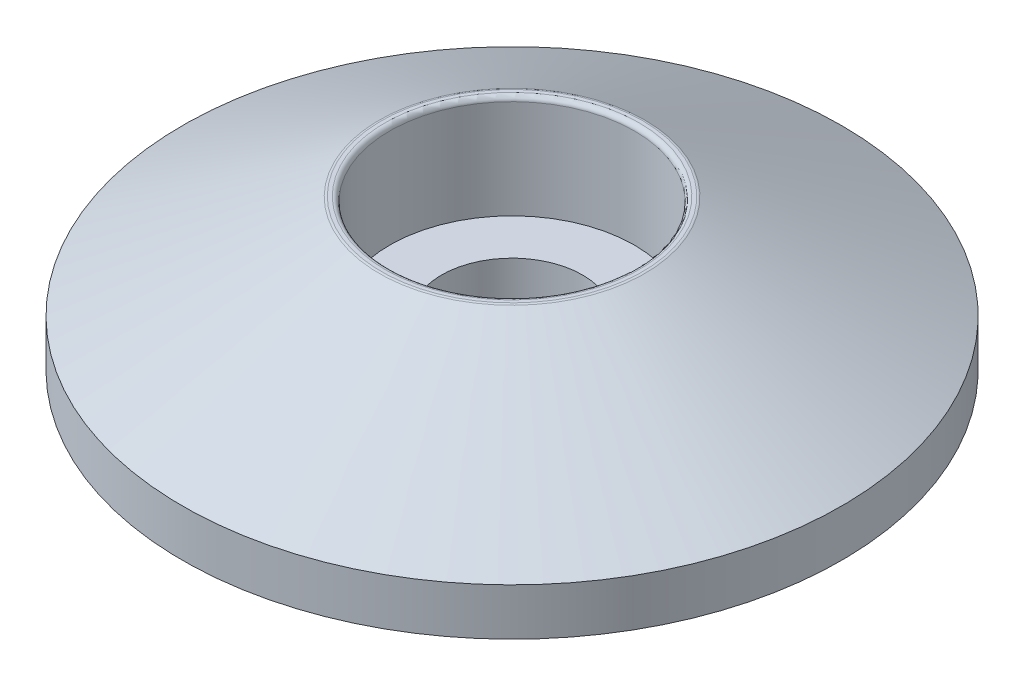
from build123d import *


with BuildPart() as part:
    # Esquisse1 → R_volution1 (revolve)
    with BuildSketch(Plane.XY, mode=Mode.PRIVATE) as r_volution1_sk:
        with BuildLine():
            Line((7, 0), (1.5, 0))
            Line((1.5, 0), (1.5, 1))
            Line((1.5, 1), (2.6, 1))
            Line((2.6, 1), (2.6, 3.1))
            ThreePointArc((2.6, 3.1), (2.629289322, 3.170710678), (2.7, 3.2))
            Line((2.7, 3.2), (2.775395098, 3.2))
            ThreePointArc((2.775395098, 3.2), (2.799287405, 3.19710385), (2.821795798, 3.188583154))
            Line((2.821795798, 3.188583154), (7, 1))
            Line((7, 1), (7, 0))
        make_face()
    revolve(r_volution1_sk.sketch.rotate(Axis((0, -13.09557377, 0), (0, 1, 0)), 90), axis=Axis((0, -13.09557377, 0), (0, 1, 0)))


solid = part.part
